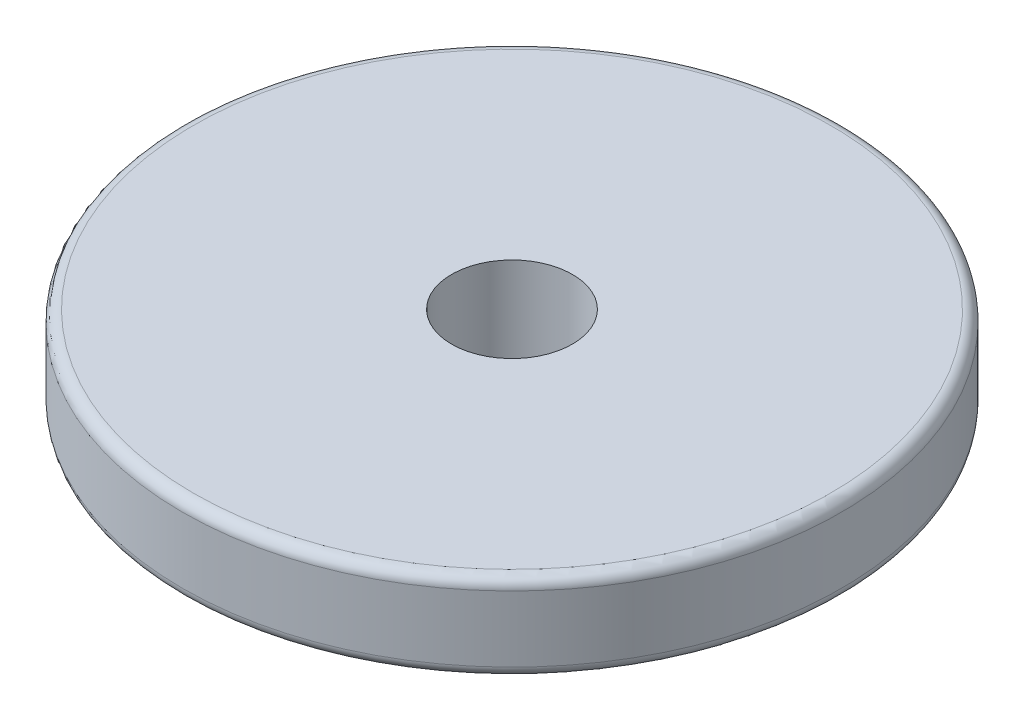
from build123d import *

# Parameters (mm, degrees)
SKETCH1_R      = 15
SKETCH1_R_2    = 2.75
EXTRUDE1_DEPTH = 4
FILLET1_R      = 0.5


with BuildPart() as part:
    # Sketch1 → Extrude1 (new body)
    with BuildSketch(Plane(origin=(0, 0, 0), x_dir=(1, 0, 0), z_dir=(0, 1, 0))):
        with Locations(Location((0, 0, 0), (0, 0, 270))):
            Circle(SKETCH1_R)
        with Locations(Location((0, 0, 0), (0, 0, 270))):
            Circle(SKETCH1_R_2, mode=Mode.SUBTRACT)
    extrude(amount=EXTRUDE1_DEPTH)

    # Fillet1
    fillet1_edges = [part.edges().sort_by_distance(p)[0] for p in [
        (0, 0, -15),
        (0, 4, -15),
    ]]
    fillet(fillet1_edges, radius=FILLET1_R)


solid = part.part
